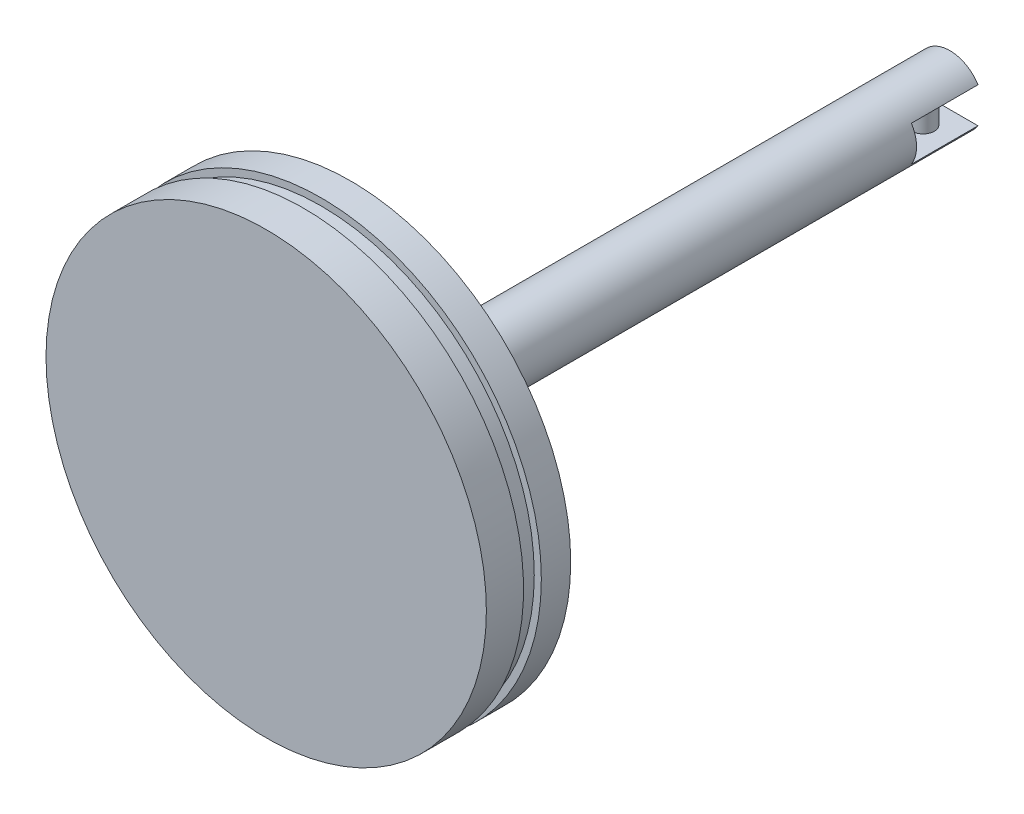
from build123d import *

# Parameters (mm, degrees)
SKETCH1_R           = 49.6
BOSS_EXTRUDE1_DEPTH = 3
SKETCH2_R           = 49.6
SKETCH2_R_2         = 46
BOSS_EXTRUDE2_DEPTH = 15
SKETCH3_R           = 49.6
BOSS_EXTRUDE3_DEPTH = 4
SKETCH4_R           = 2.5
SKETCH4_R_2         = 5
BOSS_EXTRUDE4_DEPTH = 16
SKETCH5_R           = 7.5
BOSS_EXTRUDE5_DEPTH = 135
SKETCH6_W           = 4
SKETCH6_H           = 2.877326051
SKETCH7_W           = 21.216623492
SKETCH7_H           = 8
CUT_EXTRUDE1_DEPTH  = 15
SKETCH8_R           = 2.5
BOSS_EXTRUDE6_DEPTH = 7


with BuildPart() as part:
    # Sketch1 → Boss-Extrude1 (new body)
    with BuildSketch(Plane.XY):
        Circle(SKETCH1_R)
    extrude(amount=BOSS_EXTRUDE1_DEPTH)

    # Sketch2 → Boss-Extrude2 (add)
    with BuildSketch(Plane.XY):
        Circle(SKETCH2_R)
        Circle(SKETCH2_R_2, mode=Mode.SUBTRACT)
    extrude(amount=BOSS_EXTRUDE2_DEPTH)

    # Sketch3 → Boss-Extrude3 (add)
    with BuildSketch(Plane.XY.offset(15)):
        Circle(SKETCH3_R)
    extrude(amount=BOSS_EXTRUDE3_DEPTH)

    # Sketch4 → Boss-Extrude4 (add)
    with BuildSketch(Plane.XY.offset(3)):
        with Locations((-35.987639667, -3.679667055)):
            Circle(SKETCH4_R)
        with Locations((-20.971152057, -26.371770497)):
            Circle(SKETCH4_R)
        with Locations((10.797391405, -30.746904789)):
            Circle(SKETCH4_R)
        with Locations((29.028310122, -5.229746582)):
            Circle(SKETCH4_R)
        with Locations((17.402549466, 21.919229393)):
            Circle(SKETCH4_R)
        with Locations((-12.555375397, 26.332978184)):
            Circle(SKETCH4_R)
        Circle(SKETCH4_R_2)
    extrude(amount=BOSS_EXTRUDE4_DEPTH)

    # Sketch5 → Boss-Extrude5 (add)
    with BuildSketch(Plane.XY):
        Circle(SKETCH5_R)
    extrude(amount=-BOSS_EXTRUDE5_DEPTH)

    # Sketch6 → Cut-Revolve1 (revolve, cut)
    with BuildSketch(Plane(origin=(0, 0, 0), x_dir=(0, 0, -1), z_dir=(1, 0, 0)), mode=Mode.PRIVATE) as cut_revolve1_sk:
        with Locations((-8.620257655, -49.449045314)):
            Rectangle(SKETCH6_W, SKETCH6_H)
    revolve(cut_revolve1_sk.sketch.rotate(Axis((0, 0, 0), (0, 0, 1)), 270), axis=Axis((0, 0, 0), (0, 0, 1)), mode=Mode.SUBTRACT)

    # Sketch7 → Cut-Extrude1 (cut)
    with BuildSketch(Plane(origin=(0, 0, -135), x_dir=(-1, 0, 0), z_dir=(0, 0, -1))):
        Rectangle(SKETCH7_W, SKETCH7_H)
    extrude(amount=-CUT_EXTRUDE1_DEPTH, mode=Mode.SUBTRACT)

    # Sketch8 → Boss-Extrude6 (add)
    with BuildSketch(Plane(origin=(0, -4, 0), x_dir=(1, 0, 0), z_dir=(0, 1, 0))):
        with Locations((0, 129)):
            Circle(SKETCH8_R)
    extrude(amount=BOSS_EXTRUDE6_DEPTH)


solid = part.part
